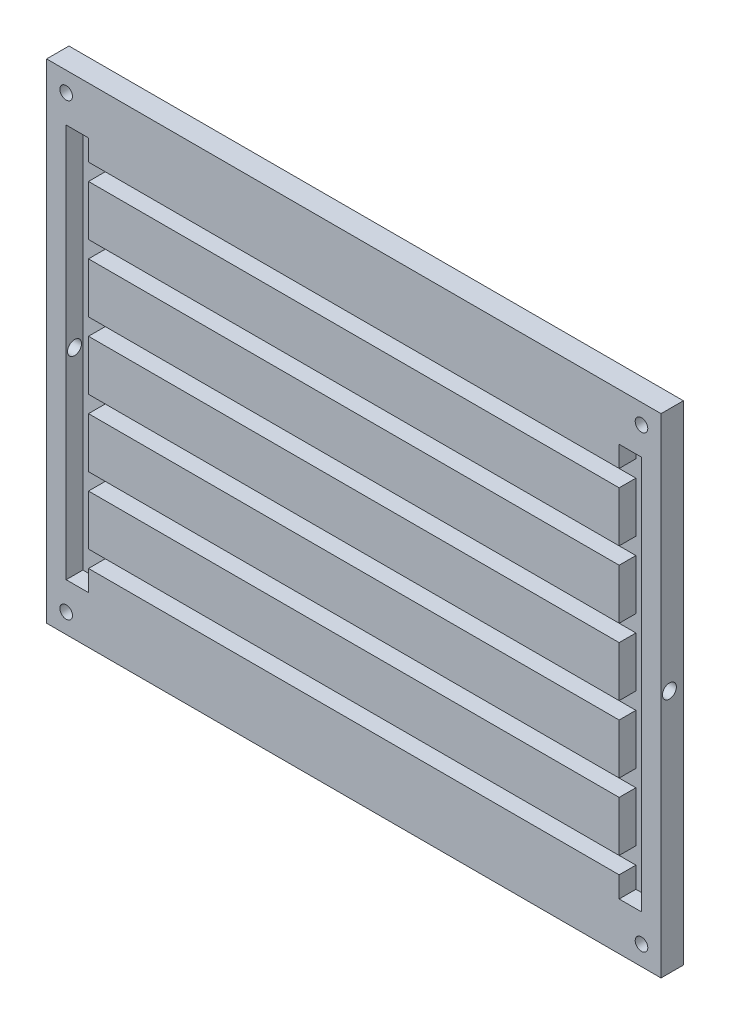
from build123d import *

# Parameters (mm, degrees)
SKETCH1_W           = 220
SKETCH1_H           = 175
BOSS_EXTRUDE1_DEPTH = 8
SKETCH2_W           = 190
SKETCH2_H           = 6
CUT_EXTRUDE1_DEPTH  = 6
SKETCH3_W           = 8
SKETCH3_H           = 141
CUT_EXTRUDE2_DEPTH  = 6
SKETCH5_R           = 2.5
CUT_EXTRUDE3_DEPTH  = 7
SKETCH6_R           = 2.5
CUT_EXTRUDE4_DEPTH  = 7
SKETCH7_R           = 2.25
CUT_EXTRUDE5_DEPTH  = 282.22766578


with BuildPart() as part:
    # Sketch1 → Boss-Extrude1 (new body)
    with BuildSketch(Plane.XY):
        with Locations((110, 87.5)):
            Rectangle(SKETCH1_W, SKETCH1_H)
    extrude(amount=BOSS_EXTRUDE1_DEPTH)

    # Sketch2 → Cut-Extrude1 (cut)
    with BuildSketch(Plane.XY.offset(8)):
        with Locations((110, 51.5)):
            Rectangle(SKETCH2_W, SKETCH2_H)
        with Locations((110, 27.5)):
            Rectangle(SKETCH2_W, SKETCH2_H)
        with Locations((110, 75.5)):
            Rectangle(SKETCH2_W, SKETCH2_H)
        with Locations((110, 99.5)):
            Rectangle(SKETCH2_W, SKETCH2_H)
        with Locations((110, 123.5)):
            Rectangle(SKETCH2_W, SKETCH2_H)
        with Locations((110, 147.5)):
            Rectangle(SKETCH2_W, SKETCH2_H)
    extrude(amount=-CUT_EXTRUDE1_DEPTH, mode=Mode.SUBTRACT)

    # Sketch3 → Cut-Extrude2 (cut)
    with BuildSketch(Plane.XY.offset(8)):
        with Locations((11, 87.5)):
            Rectangle(SKETCH3_W, SKETCH3_H)
        with Locations((209, 87.5)):
            Rectangle(SKETCH3_W, SKETCH3_H)
    extrude(amount=-CUT_EXTRUDE2_DEPTH, mode=Mode.SUBTRACT)

    # Sketch5 → Cut-Extrude3 (cut)
    with BuildSketch(Plane.ZY):
        with Locations((5, 87.494285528)):
            Circle(SKETCH5_R)
    extrude(amount=-CUT_EXTRUDE3_DEPTH, mode=Mode.SUBTRACT)

    # Sketch6 → Cut-Extrude4 (cut)
    with BuildSketch(Plane(origin=(220, 0, 0), x_dir=(0, 0, -1), z_dir=(1, 0, 0))):
        with Locations((-5, 87.5)):
            Circle(SKETCH6_R)
    extrude(amount=-CUT_EXTRUDE4_DEPTH, mode=Mode.SUBTRACT)

    # Sketch7 → Cut-Extrude5 (cut, through all)
    with BuildSketch(Plane.XY.offset(8)):
        with Locations((213, 168)):
            Circle(SKETCH7_R)
        with Locations((7, 168)):
            Circle(SKETCH7_R)
        with Locations((7, 7)):
            Circle(SKETCH7_R)
        with Locations((213, 7)):
            Circle(SKETCH7_R)
    extrude(amount=-CUT_EXTRUDE5_DEPTH, mode=Mode.SUBTRACT)


solid = part.part
